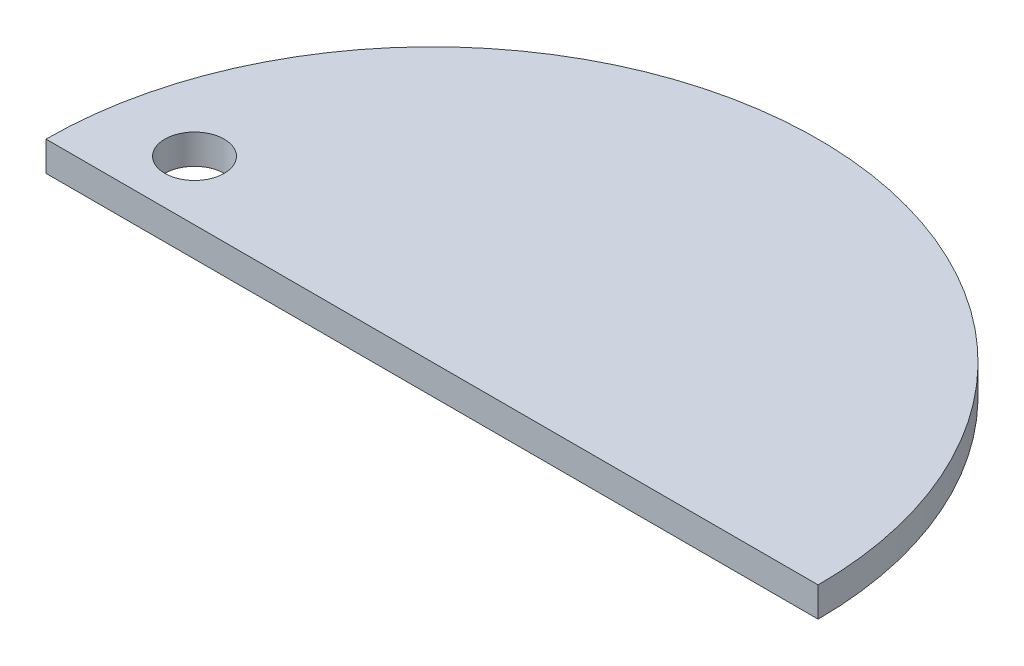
from build123d import *

# Parameters (mm, degrees)
SKETCH1_R           = 5
BOSS_EXTRUDE2_DEPTH = 5


with BuildPart() as part:
    # Sketch1 → Boss-Extrude2 (new body)
    with BuildSketch(Plane(origin=(0, 0, 0), x_dir=(1, 0, 0), z_dir=(0, 1, 0))):
        with BuildLine():
            ThreePointArc((55, -50), (-10, 15), (-75, -50))
            Line((-75, -50), (55, -50))
        make_face()
        with Locations(Location((-60, -40, 0), (0, 0, 270))):
            Circle(SKETCH1_R, mode=Mode.SUBTRACT)
    extrude(amount=BOSS_EXTRUDE2_DEPTH)


solid = part.part
